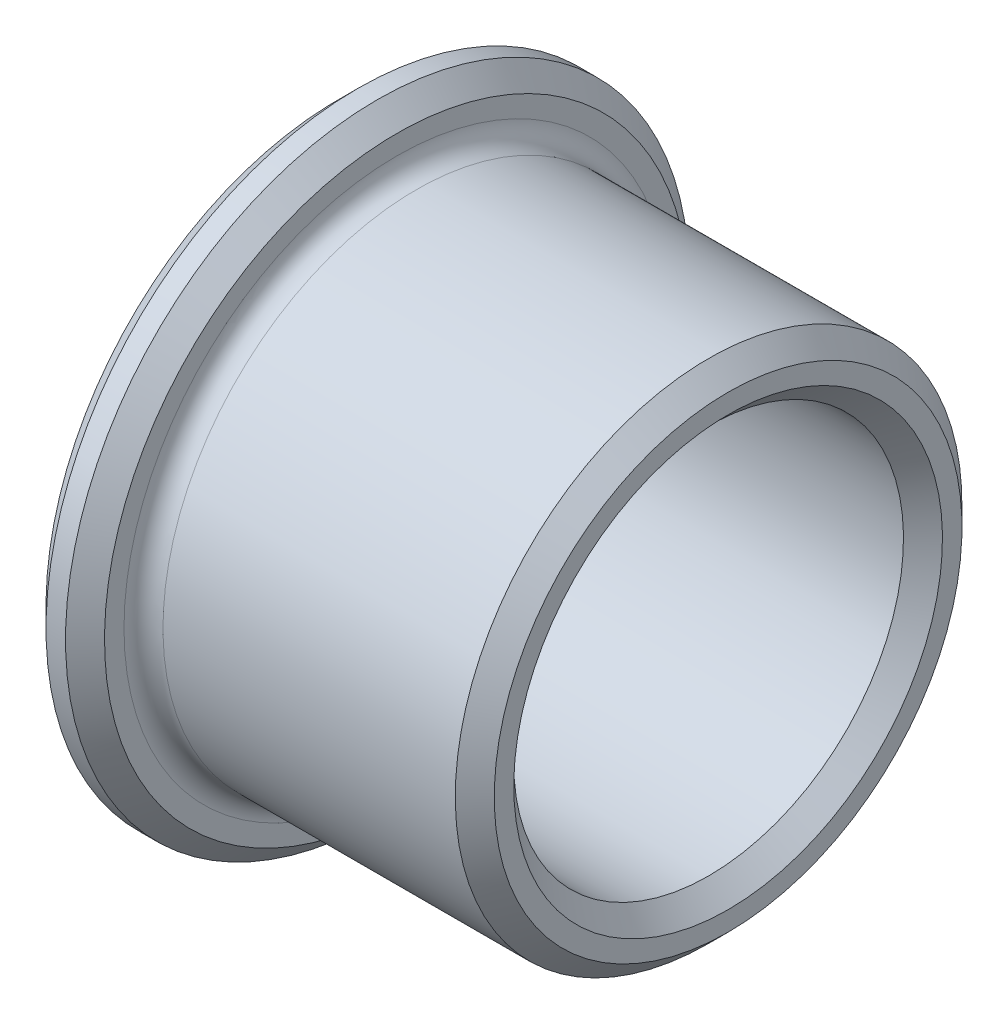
ISO-10303-21;
HEADER;
FILE_DESCRIPTION(('STEP AP214'),'2;1');
FILE_NAME('part.step','',(''),(''),'','','');
FILE_SCHEMA(('AUTOMOTIVE_DESIGN { 1 0 10303 214 1 1 1 1 }'));
ENDSEC;
DATA;
#1=APPLICATION_CONTEXT('core data for automotive mechanical design processes');
#2=APPLICATION_PROTOCOL_DEFINITION('international standard','automotive_design',2000,#1);
#3=PRODUCT_CONTEXT('',#1,'mechanical');
#4=PRODUCT('Part','Part','',(#3));
#5=PRODUCT_RELATED_PRODUCT_CATEGORY('part','',(#4));
#6=PRODUCT_DEFINITION_FORMATION('','',#4);
#7=PRODUCT_DEFINITION_CONTEXT('part definition',#1,'design');
#8=PRODUCT_DEFINITION('design','',#6,#7);
#9=PRODUCT_DEFINITION_SHAPE('','',#8);
#10=(LENGTH_UNIT() NAMED_UNIT(*) SI_UNIT(.MILLI.,.METRE.));
#11=(NAMED_UNIT(*) PLANE_ANGLE_UNIT() SI_UNIT($,.RADIAN.));
#12=(NAMED_UNIT(*) SI_UNIT($,.STERADIAN.) SOLID_ANGLE_UNIT());
#13=UNCERTAINTY_MEASURE_WITH_UNIT(LENGTH_MEASURE(1.E-05),#10,'distance_accuracy_value','');
#14=(GEOMETRIC_REPRESENTATION_CONTEXT(3) GLOBAL_UNCERTAINTY_ASSIGNED_CONTEXT((#13)) GLOBAL_UNIT_ASSIGNED_CONTEXT((#10,
#11,#12)) REPRESENTATION_CONTEXT('',''));
#15=CARTESIAN_POINT('',(0.,0.,0.));
#16=DIRECTION('',(0.,0.,1.));
#17=DIRECTION('',(1.,0.,0.));
#18=AXIS2_PLACEMENT_3D('',#15,#16,#17);
#19=CARTESIAN_POINT('',(-1.5,-6.5,0.));
#20=DIRECTION('',(-1.,0.,0.));
#21=DIRECTION('',(0.,-1.,0.));
#22=AXIS2_PLACEMENT_3D('',#19,#20,#21);
#23=PLANE('',#22);
#24=CARTESIAN_POINT('',(-1.5,0.,0.));
#25=DIRECTION('',(1.,0.,0.));
#26=DIRECTION('',(0.,-1.,0.));
#27=AXIS2_PLACEMENT_3D('',#24,#25,#26);
#28=CIRCLE('',#27,5.50000000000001);
#29=CARTESIAN_POINT('',(-1.5,-5.50000000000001,0.));
#30=VERTEX_POINT('',#29);
#31=EDGE_CURVE('E8',#30,#30,#28,.T.);
#32=ORIENTED_EDGE('',*,*,#31,.T.);
#33=EDGE_LOOP('',(#32));
#34=FACE_BOUND('',#33,.T.);
#35=CARTESIAN_POINT('',(-1.5,0.,0.));
#36=DIRECTION('',(1.,0.,0.));
#37=DIRECTION('',(0.,-1.,0.));
#38=AXIS2_PLACEMENT_3D('',#35,#36,#37);
#39=CIRCLE('',#38,7.5);
#40=CARTESIAN_POINT('',(-1.5,-7.5,0.));
#41=VERTEX_POINT('',#40);
#42=EDGE_CURVE('E42',#41,#41,#39,.T.);
#43=ORIENTED_EDGE('',*,*,#42,.F.);
#44=EDGE_LOOP('',(#43));
#45=FACE_BOUND('',#44,.T.);
#46=ADVANCED_FACE('F13',(#34,#45),#23,.T.);
#47=CARTESIAN_POINT('',(8.5,-5.75,0.));
#48=DIRECTION('',(1.,0.,0.));
#49=DIRECTION('',(0.,1.,0.));
#50=AXIS2_PLACEMENT_3D('',#47,#48,#49);
#51=PLANE('',#50);
#52=CARTESIAN_POINT('',(8.5,0.,0.));
#53=DIRECTION('',(1.,0.,0.));
#54=DIRECTION('',(0.,-1.,0.));
#55=AXIS2_PLACEMENT_3D('',#52,#53,#54);
#56=CIRCLE('',#55,5.5);
#57=CARTESIAN_POINT('',(8.5,-5.5,0.));
#58=VERTEX_POINT('',#57);
#59=EDGE_CURVE('E122',#58,#58,#56,.T.);
#60=ORIENTED_EDGE('',*,*,#59,.F.);
#61=EDGE_LOOP('',(#60));
#62=FACE_BOUND('',#61,.T.);
#63=CARTESIAN_POINT('',(8.5,0.,0.));
#64=DIRECTION('',(1.,0.,0.));
#65=DIRECTION('',(0.,-1.,0.));
#66=AXIS2_PLACEMENT_3D('',#63,#64,#65);
#67=CIRCLE('',#66,6.);
#68=CARTESIAN_POINT('',(8.5,-6.,0.));
#69=VERTEX_POINT('',#68);
#70=EDGE_CURVE('E22',#69,#69,#67,.T.);
#71=ORIENTED_EDGE('',*,*,#70,.T.);
#72=EDGE_LOOP('',(#71));
#73=FACE_BOUND('',#72,.T.);
#74=ADVANCED_FACE('F86',(#62,#73),#51,.T.);
#75=CARTESIAN_POINT('',(0.,-7.25,0.));
#76=DIRECTION('',(1.,0.,0.));
#77=DIRECTION('',(0.,1.,0.));
#78=AXIS2_PLACEMENT_3D('',#75,#76,#77);
#79=PLANE('',#78);
#80=CARTESIAN_POINT('',(0.,0.,0.));
#81=DIRECTION('',(1.,0.,0.));
#82=DIRECTION('',(0.,-1.,0.));
#83=AXIS2_PLACEMENT_3D('',#80,#81,#82);
#84=CIRCLE('',#83,7.);
#85=CARTESIAN_POINT('',(0.,-7.,0.));
#86=VERTEX_POINT('',#85);
#87=EDGE_CURVE('E36',#86,#86,#84,.T.);
#88=ORIENTED_EDGE('',*,*,#87,.F.);
#89=EDGE_LOOP('',(#88));
#90=FACE_BOUND('',#89,.T.);
#91=CARTESIAN_POINT('',(0.,0.,0.));
#92=DIRECTION('',(1.,0.,0.));
#93=DIRECTION('',(0.,-1.,0.));
#94=AXIS2_PLACEMENT_3D('',#91,#92,#93);
#95=CIRCLE('',#94,7.5);
#96=CARTESIAN_POINT('',(0.,-7.5,0.));
#97=VERTEX_POINT('',#96);
#98=EDGE_CURVE('E32',#97,#97,#95,.T.);
#99=ORIENTED_EDGE('',*,*,#98,.T.);
#100=EDGE_LOOP('',(#99));
#101=FACE_BOUND('',#100,.T.);
#102=ADVANCED_FACE('F91',(#90,#101),#79,.T.);
#103=CARTESIAN_POINT('',(-0.75,0.,0.));
#104=DIRECTION('',(1.,0.,0.));
#105=DIRECTION('',(0.,1.,0.));
#106=AXIS2_PLACEMENT_3D('',#103,#104,#105);
#107=CYLINDRICAL_SURFACE('',#106,8.);
#108=CARTESIAN_POINT('',(-0.5,0.,0.));
#109=DIRECTION('',(1.,0.,0.));
#110=DIRECTION('',(0.,-1.,0.));
#111=AXIS2_PLACEMENT_3D('',#108,#109,#110);
#112=CIRCLE('',#111,8.);
#113=CARTESIAN_POINT('',(-0.500000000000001,-8.,0.));
#114=VERTEX_POINT('',#113);
#115=EDGE_CURVE('E114',#114,#114,#112,.T.);
#116=ORIENTED_EDGE('',*,*,#115,.F.);
#117=EDGE_LOOP('',(#116));
#118=FACE_BOUND('',#117,.T.);
#119=CARTESIAN_POINT('',(-1.,0.,0.));
#120=DIRECTION('',(1.,0.,0.));
#121=DIRECTION('',(0.,-1.,0.));
#122=AXIS2_PLACEMENT_3D('',#119,#120,#121);
#123=CIRCLE('',#122,8.);
#124=CARTESIAN_POINT('',(-1.,-8.,0.));
#125=VERTEX_POINT('',#124);
#126=EDGE_CURVE('E107',#125,#125,#123,.T.);
#127=ORIENTED_EDGE('',*,*,#126,.T.);
#128=EDGE_LOOP('',(#127));
#129=FACE_BOUND('',#128,.T.);
#130=ADVANCED_FACE('F54',(#118,#129),#107,.T.);
#131=DIRECTION('',(0.707106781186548,0.707106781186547,0.));
#132=VECTOR('',#131,1.);
#133=CARTESIAN_POINT('',(-0.250000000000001,-7.75,0.));
#134=LINE('',#133,#132);
#135=CARTESIAN_POINT('',(7.50000000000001,0.,0.));
#136=DIRECTION('',(-1.,0.,0.));
#137=AXIS1_PLACEMENT('',#135,#136);
#138=SURFACE_OF_REVOLUTION('',#134,#137);
#139=ORIENTED_EDGE('',*,*,#98,.F.);
#140=EDGE_LOOP('',(#139));
#141=FACE_BOUND('',#140,.T.);
#142=ORIENTED_EDGE('',*,*,#115,.T.);
#143=EDGE_LOOP('',(#142));
#144=FACE_BOUND('',#143,.T.);
#145=ADVANCED_FACE('F49',(#141,#144),#138,.F.);
#146=CARTESIAN_POINT('',(0.5,0.,0.));
#147=DIRECTION('',(1.,0.,0.));
#148=DIRECTION('',(0.,0.,-1.));
#149=AXIS2_PLACEMENT_3D('',#146,#147,#148);
#150=TOROIDAL_SURFACE('',#149,7.,0.5);
#151=ORIENTED_EDGE('',*,*,#87,.T.);
#152=EDGE_LOOP('',(#151));
#153=FACE_BOUND('',#152,.T.);
#154=CARTESIAN_POINT('',(0.5,0.,0.));
#155=DIRECTION('',(1.,0.,0.));
#156=DIRECTION('',(0.,-1.,0.));
#157=AXIS2_PLACEMENT_3D('',#154,#155,#156);
#158=CIRCLE('',#157,6.5);
#159=CARTESIAN_POINT('',(0.499999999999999,-6.5,0.));
#160=VERTEX_POINT('',#159);
#161=EDGE_CURVE('E118',#160,#160,#158,.T.);
#162=ORIENTED_EDGE('',*,*,#161,.F.);
#163=EDGE_LOOP('',(#162));
#164=FACE_BOUND('',#163,.T.);
#165=ADVANCED_FACE('F53',(#153,#164),#150,.F.);
#166=CARTESIAN_POINT('',(4.25,0.,0.));
#167=DIRECTION('',(1.,0.,0.));
#168=DIRECTION('',(0.,1.,0.));
#169=AXIS2_PLACEMENT_3D('',#166,#167,#168);
#170=CYLINDRICAL_SURFACE('',#169,6.5);
#171=CARTESIAN_POINT('',(8.,0.,0.));
#172=DIRECTION('',(1.,0.,0.));
#173=DIRECTION('',(0.,-1.,0.));
#174=AXIS2_PLACEMENT_3D('',#171,#172,#173);
#175=CIRCLE('',#174,6.5);
#176=CARTESIAN_POINT('',(8.,-6.5,0.));
#177=VERTEX_POINT('',#176);
#178=EDGE_CURVE('E119',#177,#177,#175,.T.);
#179=ORIENTED_EDGE('',*,*,#178,.F.);
#180=EDGE_LOOP('',(#179));
#181=FACE_BOUND('',#180,.T.);
#182=ORIENTED_EDGE('',*,*,#161,.T.);
#183=EDGE_LOOP('',(#182));
#184=FACE_BOUND('',#183,.T.);
#185=ADVANCED_FACE('F59',(#181,#184),#170,.T.);
#186=DIRECTION('',(0.707106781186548,0.707106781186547,0.));
#187=VECTOR('',#186,1.);
#188=CARTESIAN_POINT('',(-498985.5,-499000.,-1.22215714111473E-10));
#189=LINE('',#188,#187);
#190=CARTESIAN_POINT('',(14.5,0.,0.));
#191=DIRECTION('',(-1.,0.,0.));
#192=AXIS1_PLACEMENT('',#190,#191);
#193=SURFACE_OF_REVOLUTION('',#189,#192);
#194=ORIENTED_EDGE('',*,*,#70,.F.);
#195=EDGE_LOOP('',(#194));
#196=FACE_BOUND('',#195,.T.);
#197=ORIENTED_EDGE('',*,*,#178,.T.);
#198=EDGE_LOOP('',(#197));
#199=FACE_BOUND('',#198,.T.);
#200=ADVANCED_FACE('F63',(#196,#199),#193,.F.);
#201=DIRECTION('',(0.707106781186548,-0.707106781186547,0.));
#202=VECTOR('',#201,1.);
#203=CARTESIAN_POINT('',(499000.,-498996.999999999,-1.2221497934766E-10));
#204=LINE('',#203,#202);
#205=CARTESIAN_POINT('',(2.99999999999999,0.,0.));
#206=DIRECTION('',(1.,0.,0.));
#207=AXIS1_PLACEMENT('',#205,#206);
#208=SURFACE_OF_REVOLUTION('',#204,#207);
#209=ORIENTED_EDGE('',*,*,#59,.T.);
#210=EDGE_LOOP('',(#209));
#211=FACE_BOUND('',#210,.T.);
#212=CARTESIAN_POINT('',(8.,0.,0.));
#213=DIRECTION('',(1.,0.,0.));
#214=DIRECTION('',(0.,-1.,0.));
#215=AXIS2_PLACEMENT_3D('',#212,#213,#214);
#216=CIRCLE('',#215,5.);
#217=CARTESIAN_POINT('',(8.,-5.,0.));
#218=VERTEX_POINT('',#217);
#219=EDGE_CURVE('E41',#218,#218,#216,.T.);
#220=ORIENTED_EDGE('',*,*,#219,.F.);
#221=EDGE_LOOP('',(#220));
#222=FACE_BOUND('',#221,.T.);
#223=ADVANCED_FACE('F67',(#211,#222),#208,.F.);
#224=CARTESIAN_POINT('',(3.5,0.,0.));
#225=DIRECTION('',(1.,0.,0.));
#226=DIRECTION('',(0.,1.,0.));
#227=AXIS2_PLACEMENT_3D('',#224,#225,#226);
#228=CYLINDRICAL_SURFACE('',#227,5.);
#229=CARTESIAN_POINT('',(-1.,0.,0.));
#230=DIRECTION('',(1.,0.,0.));
#231=DIRECTION('',(0.,-1.,0.));
#232=AXIS2_PLACEMENT_3D('',#229,#230,#231);
#233=CIRCLE('',#232,5.00000000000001);
#234=CARTESIAN_POINT('',(-1.,-5.00000000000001,0.));
#235=VERTEX_POINT('',#234);
#236=EDGE_CURVE('E38',#235,#235,#233,.T.);
#237=ORIENTED_EDGE('',*,*,#236,.F.);
#238=EDGE_LOOP('',(#237));
#239=FACE_BOUND('',#238,.T.);
#240=ORIENTED_EDGE('',*,*,#219,.T.);
#241=EDGE_LOOP('',(#240));
#242=FACE_BOUND('',#241,.T.);
#243=ADVANCED_FACE('F15',(#239,#242),#228,.F.);
#244=DIRECTION('',(-0.707106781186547,-0.707106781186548,0.));
#245=VECTOR('',#244,1.);
#246=CARTESIAN_POINT('',(-498995.999999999,-499000.,-1.22215714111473E-10));
#247=LINE('',#246,#245);
#248=CARTESIAN_POINT('',(4.,0.,0.));
#249=DIRECTION('',(-1.,0.,0.));
#250=AXIS1_PLACEMENT('',#248,#249);
#251=SURFACE_OF_REVOLUTION('',#247,#250);
#252=ORIENTED_EDGE('',*,*,#31,.F.);
#253=EDGE_LOOP('',(#252));
#254=FACE_BOUND('',#253,.T.);
#255=ORIENTED_EDGE('',*,*,#236,.T.);
#256=EDGE_LOOP('',(#255));
#257=FACE_BOUND('',#256,.T.);
#258=ADVANCED_FACE('F74',(#254,#257),#251,.F.);
#259=DIRECTION('',(-0.707106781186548,0.707106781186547,0.));
#260=VECTOR('',#259,1.);
#261=CARTESIAN_POINT('',(-1.25,-7.75,0.));
#262=LINE('',#261,#260);
#263=CARTESIAN_POINT('',(-9.00000000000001,0.,0.));
#264=DIRECTION('',(1.,0.,0.));
#265=AXIS1_PLACEMENT('',#263,#264);
#266=SURFACE_OF_REVOLUTION('',#262,#265);
#267=ORIENTED_EDGE('',*,*,#42,.T.);
#268=EDGE_LOOP('',(#267));
#269=FACE_BOUND('',#268,.T.);
#270=ORIENTED_EDGE('',*,*,#126,.F.);
#271=EDGE_LOOP('',(#270));
#272=FACE_BOUND('',#271,.T.);
#273=ADVANCED_FACE('F76',(#269,#272),#266,.F.);
#274=CLOSED_SHELL('',(#46,#74,#102,#130,#145,#165,#185,#200,#223,#243,#258,#273));
#275=MANIFOLD_SOLID_BREP('B1',#274);
#276=ADVANCED_BREP_SHAPE_REPRESENTATION('',(#18,#275),#14);
#277=SHAPE_DEFINITION_REPRESENTATION(#9,#276);
ENDSEC;
END-ISO-10303-21;
